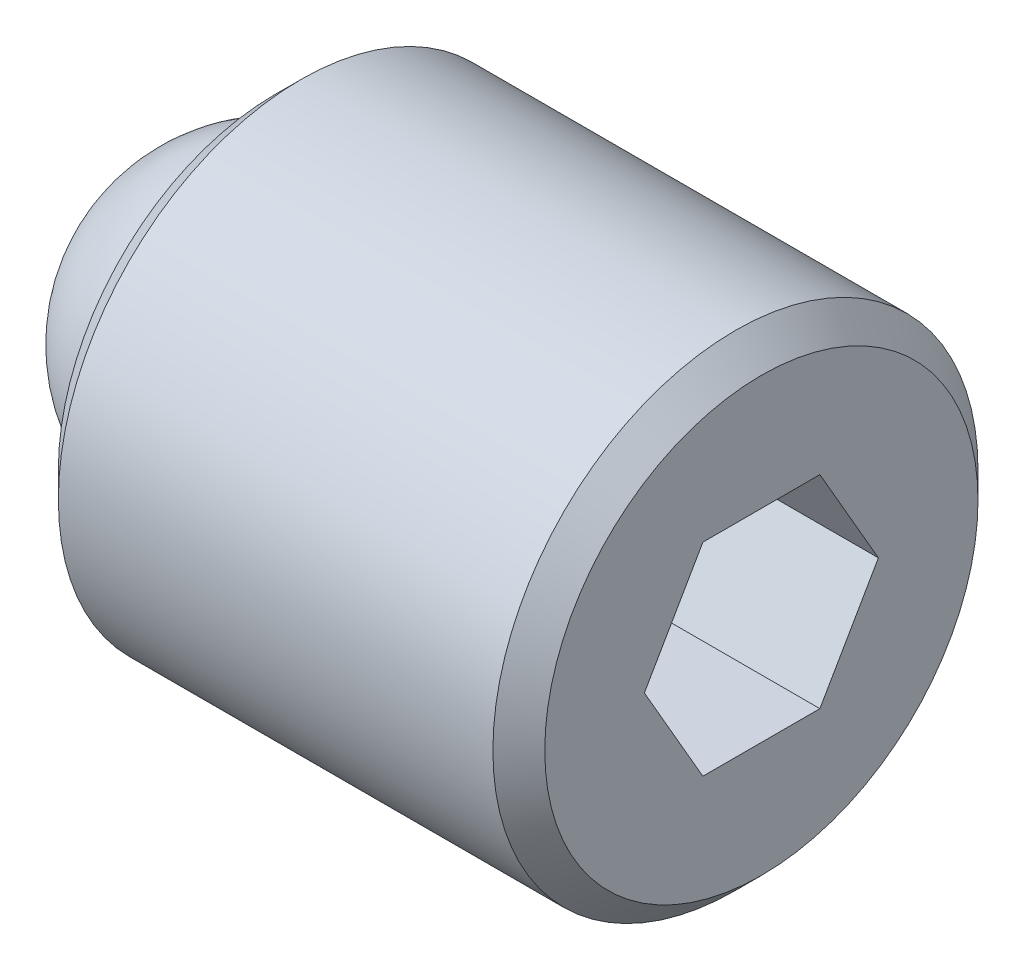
ISO-10303-21;
HEADER;
FILE_DESCRIPTION(('STEP AP214'),'2;1');
FILE_NAME('part.step','',(''),(''),'','','');
FILE_SCHEMA(('AUTOMOTIVE_DESIGN { 1 0 10303 214 1 1 1 1 }'));
ENDSEC;
DATA;
#1=APPLICATION_CONTEXT('core data for automotive mechanical design processes');
#2=APPLICATION_PROTOCOL_DEFINITION('international standard','automotive_design',2000,#1);
#3=PRODUCT_CONTEXT('',#1,'mechanical');
#4=PRODUCT('Part','Part','',(#3));
#5=PRODUCT_RELATED_PRODUCT_CATEGORY('part','',(#4));
#6=PRODUCT_DEFINITION_FORMATION('','',#4);
#7=PRODUCT_DEFINITION_CONTEXT('part definition',#1,'design');
#8=PRODUCT_DEFINITION('design','',#6,#7);
#9=PRODUCT_DEFINITION_SHAPE('','',#8);
#10=(LENGTH_UNIT() NAMED_UNIT(*) SI_UNIT(.MILLI.,.METRE.));
#11=(NAMED_UNIT(*) PLANE_ANGLE_UNIT() SI_UNIT($,.RADIAN.));
#12=(NAMED_UNIT(*) SI_UNIT($,.STERADIAN.) SOLID_ANGLE_UNIT());
#13=UNCERTAINTY_MEASURE_WITH_UNIT(LENGTH_MEASURE(1.E-05),#10,'distance_accuracy_value','');
#14=(GEOMETRIC_REPRESENTATION_CONTEXT(3) GLOBAL_UNCERTAINTY_ASSIGNED_CONTEXT((#13)) GLOBAL_UNIT_ASSIGNED_CONTEXT((#10,
#11,#12)) REPRESENTATION_CONTEXT('',''));
#15=CARTESIAN_POINT('',(0.,0.,0.));
#16=DIRECTION('',(0.,0.,1.));
#17=DIRECTION('',(1.,0.,0.));
#18=AXIS2_PLACEMENT_3D('',#15,#16,#17);
#19=CARTESIAN_POINT('',(0.,0.,0.));
#20=DIRECTION('',(0.,-1.,0.));
#21=DIRECTION('',(0.,0.,1.));
#22=AXIS2_PLACEMENT_3D('',#19,#20,#21);
#23=SPHERICAL_SURFACE('',#22,1.5875);
#24=CARTESIAN_POINT('',(0.,-1.5875,0.));
#25=VERTEX_POINT('',#24);
#26=VERTEX_LOOP('',#25);
#27=FACE_BOUND('',#26,.T.);
#28=ADVANCED_FACE('F40',(#27),#23,.T.);
#29=CLOSED_SHELL('',(#28));
#30=MANIFOLD_SOLID_BREP('B2',#29);
#31=CARTESIAN_POINT('',(4.7625,0.,0.));
#32=DIRECTION('',(-1.,0.,0.));
#33=DIRECTION('',(0.,0.,1.));
#34=AXIS2_PLACEMENT_3D('',#31,#32,#33);
#35=CYLINDRICAL_SURFACE('',#34,2.3749);
#36=CARTESIAN_POINT('',(4.50850000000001,0.,0.));
#37=DIRECTION('',(1.,0.,0.));
#38=DIRECTION('',(0.,0.,-1.));
#39=AXIS2_PLACEMENT_3D('',#36,#37,#38);
#40=CIRCLE('',#39,2.3749);
#41=CARTESIAN_POINT('',(4.50850000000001,0.,2.3749));
#42=VERTEX_POINT('',#41);
#43=EDGE_CURVE('E38',#42,#42,#40,.F.);
#44=CARTESIAN_POINT('',(0.254000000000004,0.,0.));
#45=DIRECTION('',(1.,0.,0.));
#46=DIRECTION('',(0.,0.,-1.));
#47=AXIS2_PLACEMENT_3D('',#44,#45,#46);
#48=CIRCLE('',#47,2.3749);
#49=CARTESIAN_POINT('',(0.254000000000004,0.,2.3749));
#50=VERTEX_POINT('',#49);
#51=EDGE_CURVE('E155',#50,#50,#48,.T.);
#52=CARTESIAN_POINT('',(4.50850000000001,0.,2.3749));
#53=CARTESIAN_POINT('',(4.46418229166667,0.,2.3749));
#54=CARTESIAN_POINT('',(4.41986458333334,0.,2.3749));
#55=CARTESIAN_POINT('',(4.33122916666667,0.,2.3749));
#56=CARTESIAN_POINT('',(4.28691145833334,0.,2.3749));
#57=CARTESIAN_POINT('',(4.19827604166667,0.,2.3749));
#58=CARTESIAN_POINT('',(4.15395833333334,0.,2.3749));
#59=CARTESIAN_POINT('',(4.06532291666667,0.,2.3749));
#60=CARTESIAN_POINT('',(4.02100520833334,0.,2.3749));
#61=CARTESIAN_POINT('',(3.93236979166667,0.,2.3749));
#62=CARTESIAN_POINT('',(3.88805208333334,0.,2.3749));
#63=CARTESIAN_POINT('',(3.79941666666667,0.,2.3749));
#64=CARTESIAN_POINT('',(3.75509895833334,0.,2.3749));
#65=CARTESIAN_POINT('',(3.66646354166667,0.,2.3749));
#66=CARTESIAN_POINT('',(3.62214583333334,0.,2.3749));
#67=CARTESIAN_POINT('',(3.53351041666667,0.,2.3749));
#68=CARTESIAN_POINT('',(3.48919270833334,0.,2.3749));
#69=CARTESIAN_POINT('',(3.40055729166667,0.,2.3749));
#70=CARTESIAN_POINT('',(3.35623958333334,0.,2.3749));
#71=CARTESIAN_POINT('',(3.26760416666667,0.,2.3749));
#72=CARTESIAN_POINT('',(3.22328645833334,0.,2.3749));
#73=CARTESIAN_POINT('',(3.13465104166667,0.,2.3749));
#74=CARTESIAN_POINT('',(3.09033333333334,0.,2.3749));
#75=CARTESIAN_POINT('',(3.00169791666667,0.,2.3749));
#76=CARTESIAN_POINT('',(2.95738020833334,0.,2.3749));
#77=CARTESIAN_POINT('',(2.86874479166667,0.,2.3749));
#78=CARTESIAN_POINT('',(2.82442708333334,0.,2.3749));
#79=CARTESIAN_POINT('',(2.73579166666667,0.,2.3749));
#80=CARTESIAN_POINT('',(2.69147395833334,0.,2.3749));
#81=CARTESIAN_POINT('',(2.60283854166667,0.,2.3749));
#82=CARTESIAN_POINT('',(2.55852083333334,0.,2.3749));
#83=CARTESIAN_POINT('',(2.46988541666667,0.,2.3749));
#84=CARTESIAN_POINT('',(2.42556770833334,0.,2.3749));
#85=CARTESIAN_POINT('',(2.33693229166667,0.,2.3749));
#86=CARTESIAN_POINT('',(2.29261458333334,0.,2.3749));
#87=CARTESIAN_POINT('',(2.20397916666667,0.,2.3749));
#88=CARTESIAN_POINT('',(2.15966145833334,0.,2.3749));
#89=CARTESIAN_POINT('',(2.07102604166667,0.,2.3749));
#90=CARTESIAN_POINT('',(2.02670833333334,0.,2.3749));
#91=CARTESIAN_POINT('',(1.93807291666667,0.,2.3749));
#92=CARTESIAN_POINT('',(1.89375520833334,0.,2.3749));
#93=CARTESIAN_POINT('',(1.80511979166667,0.,2.3749));
#94=CARTESIAN_POINT('',(1.76080208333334,0.,2.3749));
#95=CARTESIAN_POINT('',(1.67216666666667,0.,2.3749));
#96=CARTESIAN_POINT('',(1.62784895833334,0.,2.3749));
#97=CARTESIAN_POINT('',(1.53921354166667,0.,2.3749));
#98=CARTESIAN_POINT('',(1.49489583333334,0.,2.3749));
#99=CARTESIAN_POINT('',(1.40626041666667,0.,2.3749));
#100=CARTESIAN_POINT('',(1.36194270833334,0.,2.3749));
#101=CARTESIAN_POINT('',(1.27330729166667,0.,2.3749));
#102=CARTESIAN_POINT('',(1.22898958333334,0.,2.3749));
#103=CARTESIAN_POINT('',(1.14035416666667,0.,2.3749));
#104=CARTESIAN_POINT('',(1.09603645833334,0.,2.3749));
#105=CARTESIAN_POINT('',(1.00740104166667,0.,2.3749));
#106=CARTESIAN_POINT('',(0.963083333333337,0.,2.3749));
#107=CARTESIAN_POINT('',(0.87444791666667,0.,2.3749));
#108=CARTESIAN_POINT('',(0.830130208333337,0.,2.3749));
#109=CARTESIAN_POINT('',(0.74149479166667,0.,2.3749));
#110=CARTESIAN_POINT('',(0.697177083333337,0.,2.3749));
#111=CARTESIAN_POINT('',(0.60854166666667,0.,2.3749));
#112=CARTESIAN_POINT('',(0.564223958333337,0.,2.3749));
#113=CARTESIAN_POINT('',(0.475588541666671,0.,2.3749));
#114=CARTESIAN_POINT('',(0.431270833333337,0.,2.3749));
#115=CARTESIAN_POINT('',(0.342635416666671,0.,2.3749));
#116=CARTESIAN_POINT('',(0.298317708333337,0.,2.3749));
#117=CARTESIAN_POINT('',(0.254000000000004,0.,2.3749));
#118=B_SPLINE_CURVE_WITH_KNOTS('',3,(#52,#53,#54,#55,#56,#57,#58,#59,#60,#61,#62,#63,#64,#65,
#66,#67,#68,#69,#70,#71,#72,#73,#74,#75,#76,#77,#78,#79,#80,#81,#82,#83,#84,#85,#86,#87,#88,#89,
#90,#91,#92,#93,#94,#95,#96,#97,#98,#99,#100,#101,#102,#103,#104,#105,#106,#107,#108,#109,#110,
#111,#112,#113,#114,#115,#116,#117),.UNSPECIFIED.,.F.,.F.,(4,2,2,2,2,2,2,2,2,2,2,2,2,2,2,2,2,2,
2,2,2,2,2,2,2,2,2,2,2,2,2,2,4),(0.,0.132953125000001,0.265906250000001,0.398859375,0.5318125,
0.664765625,0.797718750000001,0.930671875,1.063625,1.196578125,1.32953125,1.462484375,1.5954375,
1.728390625,1.86134375,1.994296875,2.12725,2.260203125,2.39315625,2.526109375,2.6590625,
2.792015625,2.92496875,3.057921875,3.190875,3.323828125,3.45678125,3.589734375,3.7226875,
3.855640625,3.98859375,4.121546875,4.2545),.UNSPECIFIED.);
#119=EDGE_CURVE('BSEAM52',#42,#50,#118,.T.);
#120=ORIENTED_EDGE('',*,*,#43,.T.);
#121=ORIENTED_EDGE('',*,*,#51,.T.);
#122=ORIENTED_EDGE('',*,*,#119,.T.);
#123=ORIENTED_EDGE('',*,*,#119,.F.);
#124=EDGE_LOOP('',(#120,#122,#121,#123));
#125=FACE_BOUND('',#124,.T.);
#126=ADVANCED_FACE('F52',(#125),#35,.T.);
#127=CARTESIAN_POINT('',(4.7625,0.,0.));
#128=DIRECTION('',(1.,0.,0.));
#129=DIRECTION('',(0.,0.,-1.));
#130=AXIS2_PLACEMENT_3D('',#127,#128,#129);
#131=PLANE('',#130);
#132=DIRECTION('',(0.,0.866025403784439,-0.5));
#133=VECTOR('',#132,1.);
#134=CARTESIAN_POINT('',(4.7625,-0.992187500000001,-0.572839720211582));
#135=LINE('',#134,#133);
#136=CARTESIAN_POINT('',(4.7625,-0.992187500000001,-0.572839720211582));
#137=VERTEX_POINT('',#136);
#138=CARTESIAN_POINT('',(4.7625,0.,-1.14567944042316));
#139=VERTEX_POINT('',#138);
#140=EDGE_CURVE('E67',#137,#139,#135,.T.);
#141=ORIENTED_EDGE('',*,*,#140,.F.);
#142=DIRECTION('',(0.,0.,-1.));
#143=VECTOR('',#142,1.);
#144=CARTESIAN_POINT('',(4.7625,-0.992187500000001,0.572839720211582));
#145=LINE('',#144,#143);
#146=CARTESIAN_POINT('',(4.7625,-0.992187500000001,0.572839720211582));
#147=VERTEX_POINT('',#146);
#148=EDGE_CURVE('E151',#147,#137,#145,.T.);
#149=ORIENTED_EDGE('',*,*,#148,.F.);
#150=DIRECTION('',(0.,-0.866025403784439,-0.5));
#151=VECTOR('',#150,1.);
#152=CARTESIAN_POINT('',(4.7625,0.,1.14567944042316));
#153=LINE('',#152,#151);
#154=CARTESIAN_POINT('',(4.7625,0.,1.14567944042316));
#155=VERTEX_POINT('',#154);
#156=EDGE_CURVE('E149',#155,#147,#153,.T.);
#157=ORIENTED_EDGE('',*,*,#156,.F.);
#158=DIRECTION('',(0.,-0.866025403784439,0.5));
#159=VECTOR('',#158,1.);
#160=CARTESIAN_POINT('',(4.7625,0.992187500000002,0.572839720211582));
#161=LINE('',#160,#159);
#162=CARTESIAN_POINT('',(4.7625,0.992187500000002,0.572839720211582));
#163=VERTEX_POINT('',#162);
#164=EDGE_CURVE('E115',#163,#155,#161,.T.);
#165=ORIENTED_EDGE('',*,*,#164,.F.);
#166=DIRECTION('',(0.,0.,1.));
#167=VECTOR('',#166,1.);
#168=CARTESIAN_POINT('',(4.7625,0.992187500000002,-0.572839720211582));
#169=LINE('',#168,#167);
#170=CARTESIAN_POINT('',(4.7625,0.992187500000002,-0.572839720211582));
#171=VERTEX_POINT('',#170);
#172=EDGE_CURVE('E145',#171,#163,#169,.T.);
#173=ORIENTED_EDGE('',*,*,#172,.F.);
#174=DIRECTION('',(0.,0.866025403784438,0.5));
#175=VECTOR('',#174,1.);
#176=CARTESIAN_POINT('',(4.7625,0.,-1.14567944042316));
#177=LINE('',#176,#175);
#178=EDGE_CURVE('E141',#139,#171,#177,.T.);
#179=ORIENTED_EDGE('',*,*,#178,.F.);
#180=EDGE_LOOP('',(#141,#149,#157,#165,#173,#179));
#181=FACE_BOUND('',#180,.T.);
#182=CARTESIAN_POINT('',(4.7625,0.,0.));
#183=DIRECTION('',(1.,0.,0.));
#184=DIRECTION('',(0.,0.,-1.));
#185=AXIS2_PLACEMENT_3D('',#182,#183,#184);
#186=CIRCLE('',#185,2.12090000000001);
#187=CARTESIAN_POINT('',(4.7625,0.,-2.12090000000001));
#188=VERTEX_POINT('',#187);
#189=EDGE_CURVE('E60',#188,#188,#186,.T.);
#190=ORIENTED_EDGE('',*,*,#189,.T.);
#191=EDGE_LOOP('',(#190));
#192=FACE_BOUND('',#191,.T.);
#193=ADVANCED_FACE('F168',(#181,#192),#131,.T.);
#194=CARTESIAN_POINT('',(0.,0.,0.));
#195=DIRECTION('',(1.,0.,0.));
#196=DIRECTION('',(0.,0.,-1.));
#197=AXIS2_PLACEMENT_3D('',#194,#195,#196);
#198=PLANE('',#197);
#199=CARTESIAN_POINT('',(0.,0.,0.));
#200=DIRECTION('',(-1.,0.,0.));
#201=DIRECTION('',(0.,0.,1.));
#202=AXIS2_PLACEMENT_3D('',#199,#200,#201);
#203=CIRCLE('',#202,1.5875);
#204=CARTESIAN_POINT('',(0.,0.,1.5875));
#205=VERTEX_POINT('',#204);
#206=EDGE_CURVE('E223',#205,#205,#203,.T.);
#207=ORIENTED_EDGE('',*,*,#206,.F.);
#208=EDGE_LOOP('',(#207));
#209=FACE_BOUND('',#208,.T.);
#210=CARTESIAN_POINT('',(0.,0.,0.));
#211=DIRECTION('',(1.,0.,0.));
#212=DIRECTION('',(0.,0.,-1.));
#213=AXIS2_PLACEMENT_3D('',#210,#211,#212);
#214=CIRCLE('',#213,2.12089999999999);
#215=CARTESIAN_POINT('',(0.,0.,-2.12089999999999));
#216=VERTEX_POINT('',#215);
#217=EDGE_CURVE('E163',#216,#216,#214,.F.);
#218=ORIENTED_EDGE('',*,*,#217,.T.);
#219=EDGE_LOOP('',(#218));
#220=FACE_BOUND('',#219,.T.);
#221=ADVANCED_FACE('F180',(#209,#220),#198,.F.);
#222=CARTESIAN_POINT('',(0.254000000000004,0.,0.));
#223=DIRECTION('',(1.,0.,0.));
#224=DIRECTION('',(0.,0.,-1.));
#225=AXIS2_PLACEMENT_3D('',#222,#223,#224);
#226=CONICAL_SURFACE('',#225,2.3749,0.785398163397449);
#227=ORIENTED_EDGE('',*,*,#217,.F.);
#228=EDGE_LOOP('',(#227));
#229=FACE_BOUND('',#228,.T.);
#230=ORIENTED_EDGE('',*,*,#51,.F.);
#231=EDGE_LOOP('',(#230));
#232=FACE_BOUND('',#231,.T.);
#233=ADVANCED_FACE('F172',(#229,#232),#226,.T.);
#234=CARTESIAN_POINT('',(4.7625,0.,0.));
#235=DIRECTION('',(-1.,0.,0.));
#236=DIRECTION('',(0.,0.,1.));
#237=AXIS2_PLACEMENT_3D('',#234,#235,#236);
#238=CONICAL_SURFACE('',#237,2.12090000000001,0.785398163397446);
#239=ORIENTED_EDGE('',*,*,#43,.F.);
#240=EDGE_LOOP('',(#239));
#241=FACE_BOUND('',#240,.T.);
#242=ORIENTED_EDGE('',*,*,#189,.F.);
#243=EDGE_LOOP('',(#242));
#244=FACE_BOUND('',#243,.T.);
#245=ADVANCED_FACE('F54',(#241,#244),#238,.T.);
#246=CARTESIAN_POINT('',(2.4765,-0.992187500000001,-0.572839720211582));
#247=DIRECTION('',(0.,-0.5,-0.866025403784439));
#248=DIRECTION('',(0.,0.866025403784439,-0.5));
#249=AXIS2_PLACEMENT_3D('',#246,#247,#248);
#250=PLANE('',#249);
#251=ORIENTED_EDGE('',*,*,#140,.T.);
#252=DIRECTION('',(1.,0.,0.));
#253=VECTOR('',#252,1.);
#254=CARTESIAN_POINT('',(2.4765,0.,-1.14567944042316));
#255=LINE('',#254,#253);
#256=CARTESIAN_POINT('',(2.4765,0.,-1.14567944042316));
#257=VERTEX_POINT('',#256);
#258=EDGE_CURVE('E97',#257,#139,#255,.T.);
#259=ORIENTED_EDGE('',*,*,#258,.F.);
#260=DIRECTION('',(0.,0.866025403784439,-0.5));
#261=VECTOR('',#260,1.);
#262=CARTESIAN_POINT('',(2.4765,-0.992187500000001,-0.572839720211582));
#263=LINE('',#262,#261);
#264=CARTESIAN_POINT('',(2.4765,-0.992187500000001,-0.572839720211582));
#265=VERTEX_POINT('',#264);
#266=EDGE_CURVE('E153',#265,#257,#263,.T.);
#267=ORIENTED_EDGE('',*,*,#266,.F.);
#268=DIRECTION('',(1.,0.,0.));
#269=VECTOR('',#268,1.);
#270=CARTESIAN_POINT('',(2.4765,-0.992187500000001,-0.572839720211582));
#271=LINE('',#270,#269);
#272=EDGE_CURVE('E75',#265,#137,#271,.T.);
#273=ORIENTED_EDGE('',*,*,#272,.T.);
#274=EDGE_LOOP('',(#251,#259,#267,#273));
#275=FACE_BOUND('',#274,.T.);
#276=ADVANCED_FACE('F171',(#275),#250,.F.);
#277=CARTESIAN_POINT('',(2.4765,-0.992187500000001,0.572839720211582));
#278=DIRECTION('',(0.,-1.,0.));
#279=DIRECTION('',(0.,0.,-1.));
#280=AXIS2_PLACEMENT_3D('',#277,#278,#279);
#281=PLANE('',#280);
#282=ORIENTED_EDGE('',*,*,#148,.T.);
#283=ORIENTED_EDGE('',*,*,#272,.F.);
#284=DIRECTION('',(0.,0.,-1.));
#285=VECTOR('',#284,1.);
#286=CARTESIAN_POINT('',(2.4765,-0.992187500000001,0.572839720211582));
#287=LINE('',#286,#285);
#288=CARTESIAN_POINT('',(2.4765,-0.992187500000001,0.572839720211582));
#289=VERTEX_POINT('',#288);
#290=EDGE_CURVE('E127',#289,#265,#287,.T.);
#291=ORIENTED_EDGE('',*,*,#290,.F.);
#292=DIRECTION('',(1.,0.,0.));
#293=VECTOR('',#292,1.);
#294=CARTESIAN_POINT('',(2.4765,-0.992187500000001,0.572839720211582));
#295=LINE('',#294,#293);
#296=EDGE_CURVE('E119',#289,#147,#295,.T.);
#297=ORIENTED_EDGE('',*,*,#296,.T.);
#298=EDGE_LOOP('',(#282,#283,#291,#297));
#299=FACE_BOUND('',#298,.T.);
#300=ADVANCED_FACE('F178',(#299),#281,.F.);
#301=CARTESIAN_POINT('',(2.4765,0.,1.14567944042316));
#302=DIRECTION('',(0.,-0.5,0.866025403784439));
#303=DIRECTION('',(0.,-0.866025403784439,-0.5));
#304=AXIS2_PLACEMENT_3D('',#301,#302,#303);
#305=PLANE('',#304);
#306=ORIENTED_EDGE('',*,*,#156,.T.);
#307=ORIENTED_EDGE('',*,*,#296,.F.);
#308=DIRECTION('',(0.,-0.866025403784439,-0.5));
#309=VECTOR('',#308,1.);
#310=CARTESIAN_POINT('',(2.4765,0.,1.14567944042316));
#311=LINE('',#310,#309);
#312=CARTESIAN_POINT('',(2.4765,0.,1.14567944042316));
#313=VERTEX_POINT('',#312);
#314=EDGE_CURVE('E123',#313,#289,#311,.T.);
#315=ORIENTED_EDGE('',*,*,#314,.F.);
#316=DIRECTION('',(1.,0.,0.));
#317=VECTOR('',#316,1.);
#318=CARTESIAN_POINT('',(2.4765,0.,1.14567944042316));
#319=LINE('',#318,#317);
#320=EDGE_CURVE('E108',#313,#155,#319,.T.);
#321=ORIENTED_EDGE('',*,*,#320,.T.);
#322=EDGE_LOOP('',(#306,#307,#315,#321));
#323=FACE_BOUND('',#322,.T.);
#324=ADVANCED_FACE('F124',(#323),#305,.F.);
#325=CARTESIAN_POINT('',(2.4765,0.992187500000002,0.572839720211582));
#326=DIRECTION('',(0.,0.5,0.866025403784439));
#327=DIRECTION('',(0.,-0.866025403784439,0.5));
#328=AXIS2_PLACEMENT_3D('',#325,#326,#327);
#329=PLANE('',#328);
#330=ORIENTED_EDGE('',*,*,#164,.T.);
#331=ORIENTED_EDGE('',*,*,#320,.F.);
#332=DIRECTION('',(0.,-0.866025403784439,0.5));
#333=VECTOR('',#332,1.);
#334=CARTESIAN_POINT('',(2.4765,0.992187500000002,0.572839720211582));
#335=LINE('',#334,#333);
#336=CARTESIAN_POINT('',(2.4765,0.992187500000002,0.572839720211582));
#337=VERTEX_POINT('',#336);
#338=EDGE_CURVE('E112',#337,#313,#335,.T.);
#339=ORIENTED_EDGE('',*,*,#338,.F.);
#340=DIRECTION('',(1.,0.,0.));
#341=VECTOR('',#340,1.);
#342=CARTESIAN_POINT('',(2.4765,0.992187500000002,0.572839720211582));
#343=LINE('',#342,#341);
#344=EDGE_CURVE('E120',#337,#163,#343,.T.);
#345=ORIENTED_EDGE('',*,*,#344,.T.);
#346=EDGE_LOOP('',(#330,#331,#339,#345));
#347=FACE_BOUND('',#346,.T.);
#348=ADVANCED_FACE('F110',(#347),#329,.F.);
#349=CARTESIAN_POINT('',(2.4765,0.992187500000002,-0.572839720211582));
#350=DIRECTION('',(0.,1.,0.));
#351=DIRECTION('',(0.,0.,1.));
#352=AXIS2_PLACEMENT_3D('',#349,#350,#351);
#353=PLANE('',#352);
#354=ORIENTED_EDGE('',*,*,#172,.T.);
#355=ORIENTED_EDGE('',*,*,#344,.F.);
#356=DIRECTION('',(0.,0.,1.));
#357=VECTOR('',#356,1.);
#358=CARTESIAN_POINT('',(2.4765,0.992187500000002,-0.572839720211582));
#359=LINE('',#358,#357);
#360=CARTESIAN_POINT('',(2.4765,0.992187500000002,-0.572839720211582));
#361=VERTEX_POINT('',#360);
#362=EDGE_CURVE('E133',#361,#337,#359,.T.);
#363=ORIENTED_EDGE('',*,*,#362,.F.);
#364=DIRECTION('',(1.,0.,0.));
#365=VECTOR('',#364,1.);
#366=CARTESIAN_POINT('',(2.4765,0.992187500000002,-0.572839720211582));
#367=LINE('',#366,#365);
#368=EDGE_CURVE('E158',#361,#171,#367,.T.);
#369=ORIENTED_EDGE('',*,*,#368,.T.);
#370=EDGE_LOOP('',(#354,#355,#363,#369));
#371=FACE_BOUND('',#370,.T.);
#372=ADVANCED_FACE('F199',(#371),#353,.F.);
#373=CARTESIAN_POINT('',(2.4765,0.,-1.14567944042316));
#374=DIRECTION('',(0.,0.5,-0.866025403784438));
#375=DIRECTION('',(0.,0.866025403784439,0.5));
#376=AXIS2_PLACEMENT_3D('',#373,#374,#375);
#377=PLANE('',#376);
#378=ORIENTED_EDGE('',*,*,#178,.T.);
#379=ORIENTED_EDGE('',*,*,#368,.F.);
#380=DIRECTION('',(0.,0.866025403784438,0.5));
#381=VECTOR('',#380,1.);
#382=CARTESIAN_POINT('',(2.4765,0.,-1.14567944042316));
#383=LINE('',#382,#381);
#384=EDGE_CURVE('E135',#257,#361,#383,.T.);
#385=ORIENTED_EDGE('',*,*,#384,.F.);
#386=ORIENTED_EDGE('',*,*,#258,.T.);
#387=EDGE_LOOP('',(#378,#379,#385,#386));
#388=FACE_BOUND('',#387,.T.);
#389=ADVANCED_FACE('F196',(#388),#377,.F.);
#390=CARTESIAN_POINT('',(2.4765,0.,0.));
#391=DIRECTION('',(1.,0.,0.));
#392=DIRECTION('',(0.,0.,-1.));
#393=AXIS2_PLACEMENT_3D('',#390,#391,#392);
#394=PLANE('',#393);
#395=ORIENTED_EDGE('',*,*,#266,.T.);
#396=ORIENTED_EDGE('',*,*,#384,.T.);
#397=ORIENTED_EDGE('',*,*,#362,.T.);
#398=ORIENTED_EDGE('',*,*,#338,.T.);
#399=ORIENTED_EDGE('',*,*,#314,.T.);
#400=ORIENTED_EDGE('',*,*,#290,.T.);
#401=EDGE_LOOP('',(#395,#396,#397,#398,#399,#400));
#402=FACE_BOUND('',#401,.T.);
#403=ADVANCED_FACE('F130',(#402),#394,.T.);
#404=CARTESIAN_POINT('',(1.5875,0.,0.));
#405=DIRECTION('',(-1.,0.,0.));
#406=DIRECTION('',(0.,0.,1.));
#407=AXIS2_PLACEMENT_3D('',#404,#405,#406);
#408=CYLINDRICAL_SURFACE('',#407,1.5875);
#409=CARTESIAN_POINT('',(1.5875,0.,0.));
#410=DIRECTION('',(-1.,0.,0.));
#411=DIRECTION('',(0.,0.,1.));
#412=AXIS2_PLACEMENT_3D('',#409,#410,#411);
#413=CIRCLE('',#412,1.5875);
#414=CARTESIAN_POINT('',(1.5875,0.,1.5875));
#415=VERTEX_POINT('',#414);
#416=EDGE_CURVE('E142',#415,#415,#413,.T.);
#417=ORIENTED_EDGE('',*,*,#416,.F.);
#418=EDGE_LOOP('',(#417));
#419=FACE_BOUND('',#418,.T.);
#420=ORIENTED_EDGE('',*,*,#206,.T.);
#421=EDGE_LOOP('',(#420));
#422=FACE_BOUND('',#421,.T.);
#423=ADVANCED_FACE('F212',(#419,#422),#408,.F.);
#424=CARTESIAN_POINT('',(1.5875,0.,0.));
#425=DIRECTION('',(-1.,0.,0.));
#426=DIRECTION('',(0.,0.,1.));
#427=AXIS2_PLACEMENT_3D('',#424,#425,#426);
#428=PLANE('',#427);
#429=ORIENTED_EDGE('',*,*,#416,.T.);
#430=EDGE_LOOP('',(#429));
#431=FACE_BOUND('',#430,.T.);
#432=ADVANCED_FACE('F215',(#431),#428,.T.);
#433=CLOSED_SHELL('',(#126,#193,#221,#233,#245,#276,#300,#324,#348,#372,#389,#403,#423,#432));
#434=MANIFOLD_SOLID_BREP('B6',#433);
#435=ADVANCED_BREP_SHAPE_REPRESENTATION('',(#18,#30,#434),#14);
#436=SHAPE_DEFINITION_REPRESENTATION(#9,#435);
ENDSEC;
END-ISO-10303-21;
